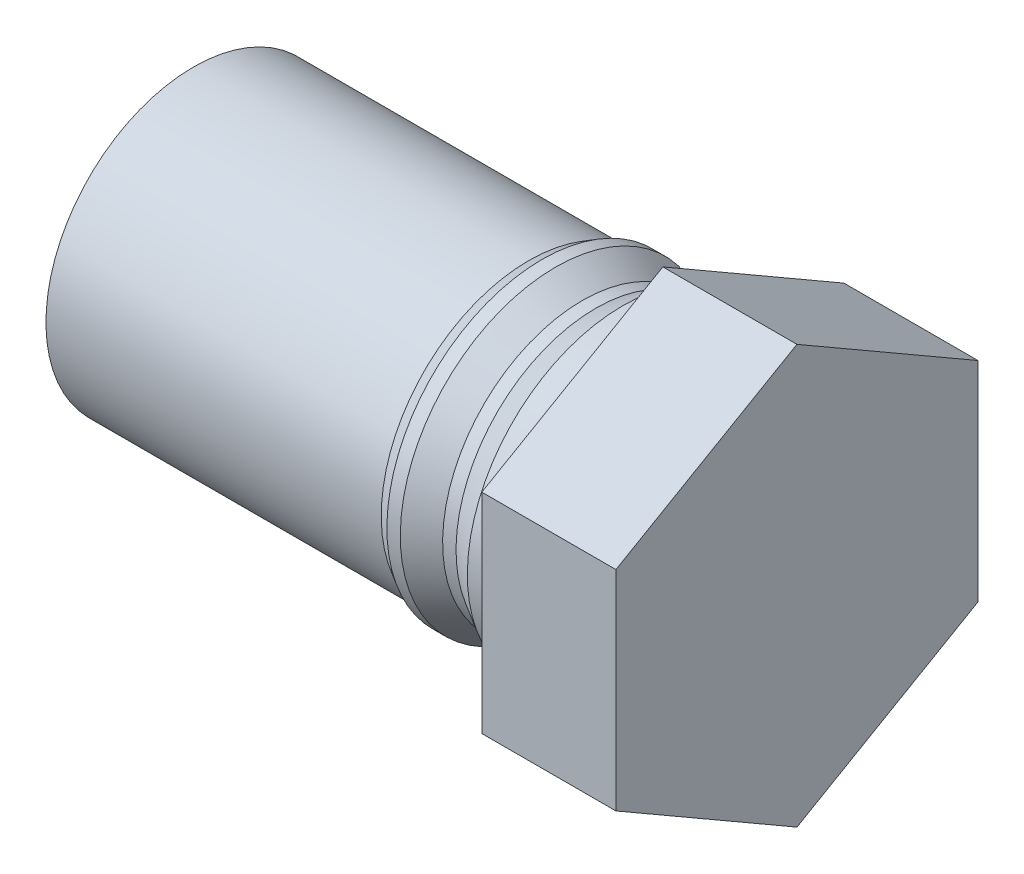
ISO-10303-21;
HEADER;
FILE_DESCRIPTION(('STEP AP214'),'2;1');
FILE_NAME('part.step','',(''),(''),'','','');
FILE_SCHEMA(('AUTOMOTIVE_DESIGN { 1 0 10303 214 1 1 1 1 }'));
ENDSEC;
DATA;
#1=APPLICATION_CONTEXT('core data for automotive mechanical design processes');
#2=APPLICATION_PROTOCOL_DEFINITION('international standard','automotive_design',2000,#1);
#3=PRODUCT_CONTEXT('',#1,'mechanical');
#4=PRODUCT('Part','Part','',(#3));
#5=PRODUCT_RELATED_PRODUCT_CATEGORY('part','',(#4));
#6=PRODUCT_DEFINITION_FORMATION('','',#4);
#7=PRODUCT_DEFINITION_CONTEXT('part definition',#1,'design');
#8=PRODUCT_DEFINITION('design','',#6,#7);
#9=PRODUCT_DEFINITION_SHAPE('','',#8);
#10=(LENGTH_UNIT() NAMED_UNIT(*) SI_UNIT(.MILLI.,.METRE.));
#11=(NAMED_UNIT(*) PLANE_ANGLE_UNIT() SI_UNIT($,.RADIAN.));
#12=(NAMED_UNIT(*) SI_UNIT($,.STERADIAN.) SOLID_ANGLE_UNIT());
#13=UNCERTAINTY_MEASURE_WITH_UNIT(LENGTH_MEASURE(1.E-05),#10,'distance_accuracy_value','');
#14=(GEOMETRIC_REPRESENTATION_CONTEXT(3) GLOBAL_UNCERTAINTY_ASSIGNED_CONTEXT((#13)) GLOBAL_UNIT_ASSIGNED_CONTEXT((#10,
#11,#12)) REPRESENTATION_CONTEXT('',''));
#15=CARTESIAN_POINT('',(0.,0.,0.));
#16=DIRECTION('',(0.,0.,1.));
#17=DIRECTION('',(1.,0.,0.));
#18=AXIS2_PLACEMENT_3D('',#15,#16,#17);
#19=CARTESIAN_POINT('',(0.,0.,0.));
#20=DIRECTION('',(-1.,0.,0.));
#21=DIRECTION('',(0.,-1.,0.));
#22=AXIS2_PLACEMENT_3D('',#19,#20,#21);
#23=PLANE('',#22);
#24=CARTESIAN_POINT('',(0.,0.,0.));
#25=DIRECTION('',(1.,0.,0.));
#26=DIRECTION('',(0.,1.,0.));
#27=AXIS2_PLACEMENT_3D('',#24,#25,#26);
#28=CIRCLE('',#27,11.);
#29=CARTESIAN_POINT('',(0.,11.,0.));
#30=VERTEX_POINT('',#29);
#31=EDGE_CURVE('E11',#30,#30,#28,.T.);
#32=ORIENTED_EDGE('',*,*,#31,.F.);
#33=EDGE_LOOP('',(#32));
#34=FACE_BOUND('',#33,.T.);
#35=ADVANCED_FACE('F33',(#34),#23,.T.);
#36=CARTESIAN_POINT('',(35.,0.,0.));
#37=DIRECTION('',(1.,0.,0.));
#38=DIRECTION('',(0.,1.,0.));
#39=AXIS2_PLACEMENT_3D('',#36,#37,#38);
#40=CYLINDRICAL_SURFACE('',#39,11.);
#41=ORIENTED_EDGE('',*,*,#31,.T.);
#42=EDGE_LOOP('',(#41));
#43=FACE_BOUND('',#42,.T.);
#44=CARTESIAN_POINT('',(25.,0.,0.));
#45=DIRECTION('',(1.,0.,0.));
#46=DIRECTION('',(0.,1.,0.));
#47=AXIS2_PLACEMENT_3D('',#44,#45,#46);
#48=CIRCLE('',#47,11.);
#49=CARTESIAN_POINT('',(25.,11.,0.));
#50=VERTEX_POINT('',#49);
#51=EDGE_CURVE('E41',#50,#50,#48,.T.);
#52=ORIENTED_EDGE('',*,*,#51,.F.);
#53=EDGE_LOOP('',(#52));
#54=FACE_BOUND('',#53,.T.);
#55=ADVANCED_FACE('F160',(#43,#54),#40,.T.);
#56=CARTESIAN_POINT('',(26.,0.,0.));
#57=DIRECTION('',(1.,0.,0.));
#58=DIRECTION('',(0.,1.,0.));
#59=AXIS2_PLACEMENT_3D('',#56,#57,#58);
#60=CONICAL_SURFACE('',#59,11.5773502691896,0.523598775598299);
#61=ORIENTED_EDGE('',*,*,#51,.T.);
#62=EDGE_LOOP('',(#61));
#63=FACE_BOUND('',#62,.T.);
#64=CARTESIAN_POINT('',(26.,0.,0.));
#65=DIRECTION('',(1.,0.,0.));
#66=DIRECTION('',(0.,1.,0.));
#67=AXIS2_PLACEMENT_3D('',#64,#65,#66);
#68=CIRCLE('',#67,11.5773502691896);
#69=CARTESIAN_POINT('',(26.,11.5773502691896,0.));
#70=VERTEX_POINT('',#69);
#71=EDGE_CURVE('E152',#70,#70,#68,.T.);
#72=ORIENTED_EDGE('',*,*,#71,.F.);
#73=EDGE_LOOP('',(#72));
#74=FACE_BOUND('',#73,.T.);
#75=ADVANCED_FACE('F157',(#63,#74),#60,.T.);
#76=CARTESIAN_POINT('',(35.,0.,0.));
#77=DIRECTION('',(1.,0.,0.));
#78=DIRECTION('',(0.,1.,0.));
#79=AXIS2_PLACEMENT_3D('',#76,#77,#78);
#80=CYLINDRICAL_SURFACE('',#79,11.5773502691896);
#81=ORIENTED_EDGE('',*,*,#71,.T.);
#82=EDGE_LOOP('',(#81));
#83=FACE_BOUND('',#82,.T.);
#84=CARTESIAN_POINT('',(27.,0.,0.));
#85=DIRECTION('',(1.,0.,0.));
#86=DIRECTION('',(0.,1.,0.));
#87=AXIS2_PLACEMENT_3D('',#84,#85,#86);
#88=CIRCLE('',#87,11.5773502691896);
#89=CARTESIAN_POINT('',(27.,11.5773502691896,0.));
#90=VERTEX_POINT('',#89);
#91=EDGE_CURVE('E149',#90,#90,#88,.T.);
#92=ORIENTED_EDGE('',*,*,#91,.F.);
#93=EDGE_LOOP('',(#92));
#94=FACE_BOUND('',#93,.T.);
#95=ADVANCED_FACE('F167',(#83,#94),#80,.T.);
#96=CARTESIAN_POINT('',(29.,0.,0.));
#97=DIRECTION('',(-1.,0.,0.));
#98=DIRECTION('',(0.,-1.,0.));
#99=AXIS2_PLACEMENT_3D('',#96,#97,#98);
#100=CONICAL_SURFACE('',#99,10.4226497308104,0.523598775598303);
#101=ORIENTED_EDGE('',*,*,#91,.T.);
#102=EDGE_LOOP('',(#101));
#103=FACE_BOUND('',#102,.T.);
#104=CARTESIAN_POINT('',(29.,0.,0.));
#105=DIRECTION('',(1.,0.,0.));
#106=DIRECTION('',(0.,1.,0.));
#107=AXIS2_PLACEMENT_3D('',#104,#105,#106);
#108=CIRCLE('',#107,10.4226497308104);
#109=CARTESIAN_POINT('',(29.,10.4226497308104,0.));
#110=VERTEX_POINT('',#109);
#111=EDGE_CURVE('E146',#110,#110,#108,.T.);
#112=ORIENTED_EDGE('',*,*,#111,.F.);
#113=EDGE_LOOP('',(#112));
#114=FACE_BOUND('',#113,.T.);
#115=ADVANCED_FACE('F173',(#103,#114),#100,.T.);
#116=CARTESIAN_POINT('',(35.,0.,0.));
#117=DIRECTION('',(1.,0.,0.));
#118=DIRECTION('',(0.,1.,0.));
#119=AXIS2_PLACEMENT_3D('',#116,#117,#118);
#120=CYLINDRICAL_SURFACE('',#119,10.4226497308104);
#121=ORIENTED_EDGE('',*,*,#111,.T.);
#122=EDGE_LOOP('',(#121));
#123=FACE_BOUND('',#122,.T.);
#124=CARTESIAN_POINT('',(30.,0.,0.));
#125=DIRECTION('',(1.,0.,0.));
#126=DIRECTION('',(0.,1.,0.));
#127=AXIS2_PLACEMENT_3D('',#124,#125,#126);
#128=CIRCLE('',#127,10.4226497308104);
#129=CARTESIAN_POINT('',(30.,10.4226497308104,0.));
#130=VERTEX_POINT('',#129);
#131=EDGE_CURVE('E143',#130,#130,#128,.T.);
#132=ORIENTED_EDGE('',*,*,#131,.F.);
#133=EDGE_LOOP('',(#132));
#134=FACE_BOUND('',#133,.T.);
#135=ADVANCED_FACE('F177',(#123,#134),#120,.T.);
#136=CARTESIAN_POINT('',(32.,0.,0.));
#137=DIRECTION('',(1.,0.,0.));
#138=DIRECTION('',(0.,1.,0.));
#139=AXIS2_PLACEMENT_3D('',#136,#137,#138);
#140=CONICAL_SURFACE('',#139,11.5773502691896,0.523598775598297);
#141=ORIENTED_EDGE('',*,*,#131,.T.);
#142=EDGE_LOOP('',(#141));
#143=FACE_BOUND('',#142,.T.);
#144=CARTESIAN_POINT('',(32.,0.,0.));
#145=DIRECTION('',(1.,0.,0.));
#146=DIRECTION('',(0.,1.,0.));
#147=AXIS2_PLACEMENT_3D('',#144,#145,#146);
#148=CIRCLE('',#147,11.5773502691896);
#149=CARTESIAN_POINT('',(32.,11.5773502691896,0.));
#150=VERTEX_POINT('',#149);
#151=EDGE_CURVE('E140',#150,#150,#148,.T.);
#152=ORIENTED_EDGE('',*,*,#151,.F.);
#153=EDGE_LOOP('',(#152));
#154=FACE_BOUND('',#153,.T.);
#155=ADVANCED_FACE('F181',(#143,#154),#140,.T.);
#156=CARTESIAN_POINT('',(35.,0.,0.));
#157=DIRECTION('',(1.,0.,0.));
#158=DIRECTION('',(0.,1.,0.));
#159=AXIS2_PLACEMENT_3D('',#156,#157,#158);
#160=CYLINDRICAL_SURFACE('',#159,11.5773502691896);
#161=ORIENTED_EDGE('',*,*,#151,.T.);
#162=EDGE_LOOP('',(#161));
#163=FACE_BOUND('',#162,.T.);
#164=CARTESIAN_POINT('',(35.,0.,0.));
#165=DIRECTION('',(1.,0.,0.));
#166=DIRECTION('',(0.,1.,0.));
#167=AXIS2_PLACEMENT_3D('',#164,#165,#166);
#168=CIRCLE('',#167,11.5773502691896);
#169=CARTESIAN_POINT('',(35.,11.5773502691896,0.));
#170=VERTEX_POINT('',#169);
#171=EDGE_CURVE('E137',#170,#170,#168,.T.);
#172=ORIENTED_EDGE('',*,*,#171,.F.);
#173=EDGE_LOOP('',(#172));
#174=FACE_BOUND('',#173,.T.);
#175=ADVANCED_FACE('F185',(#163,#174),#160,.T.);
#176=CARTESIAN_POINT('',(45.,7.79422863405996,-13.5));
#177=DIRECTION('',(0.,-0.866025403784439,0.5));
#178=DIRECTION('',(0.,-0.5,-0.866025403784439));
#179=AXIS2_PLACEMENT_3D('',#176,#177,#178);
#180=PLANE('',#179);
#181=DIRECTION('',(0.,0.5,0.866025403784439));
#182=VECTOR('',#181,1.);
#183=CARTESIAN_POINT('',(35.,7.79422863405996,-13.5));
#184=LINE('',#183,#182);
#185=CARTESIAN_POINT('',(35.,7.79422863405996,-13.5));
#186=VERTEX_POINT('',#185);
#187=CARTESIAN_POINT('',(35.,15.5884572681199,0.));
#188=VERTEX_POINT('',#187);
#189=EDGE_CURVE('E118',#186,#188,#184,.T.);
#190=ORIENTED_EDGE('',*,*,#189,.T.);
#191=DIRECTION('',(-1.,0.,0.));
#192=VECTOR('',#191,1.);
#193=CARTESIAN_POINT('',(45.,15.5884572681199,0.));
#194=LINE('',#193,#192);
#195=CARTESIAN_POINT('',(45.,15.5884572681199,0.));
#196=VERTEX_POINT('',#195);
#197=EDGE_CURVE('E135',#196,#188,#194,.T.);
#198=ORIENTED_EDGE('',*,*,#197,.F.);
#199=DIRECTION('',(0.,0.5,0.866025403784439));
#200=VECTOR('',#199,1.);
#201=CARTESIAN_POINT('',(45.,7.79422863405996,-13.5));
#202=LINE('',#201,#200);
#203=CARTESIAN_POINT('',(45.,7.79422863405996,-13.5));
#204=VERTEX_POINT('',#203);
#205=EDGE_CURVE('E128',#204,#196,#202,.T.);
#206=ORIENTED_EDGE('',*,*,#205,.F.);
#207=DIRECTION('',(-1.,0.,0.));
#208=VECTOR('',#207,1.);
#209=CARTESIAN_POINT('',(45.,7.79422863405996,-13.5));
#210=LINE('',#209,#208);
#211=EDGE_CURVE('E114',#204,#186,#210,.T.);
#212=ORIENTED_EDGE('',*,*,#211,.T.);
#213=EDGE_LOOP('',(#190,#198,#206,#212));
#214=FACE_BOUND('',#213,.T.);
#215=ADVANCED_FACE('F189',(#214),#180,.F.);
#216=CARTESIAN_POINT('',(45.,15.5884572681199,0.));
#217=DIRECTION('',(0.,-0.866025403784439,-0.5));
#218=DIRECTION('',(0.,0.5,-0.866025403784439));
#219=AXIS2_PLACEMENT_3D('',#216,#217,#218);
#220=PLANE('',#219);
#221=DIRECTION('',(0.,-0.5,0.866025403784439));
#222=VECTOR('',#221,1.);
#223=CARTESIAN_POINT('',(35.,15.5884572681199,0.));
#224=LINE('',#223,#222);
#225=CARTESIAN_POINT('',(35.,7.79422863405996,13.5));
#226=VERTEX_POINT('',#225);
#227=EDGE_CURVE('E121',#188,#226,#224,.T.);
#228=ORIENTED_EDGE('',*,*,#227,.T.);
#229=DIRECTION('',(-1.,0.,0.));
#230=VECTOR('',#229,1.);
#231=CARTESIAN_POINT('',(45.,7.79422863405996,13.5));
#232=LINE('',#231,#230);
#233=CARTESIAN_POINT('',(45.,7.79422863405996,13.5));
#234=VERTEX_POINT('',#233);
#235=EDGE_CURVE('E132',#234,#226,#232,.T.);
#236=ORIENTED_EDGE('',*,*,#235,.F.);
#237=DIRECTION('',(0.,-0.5,0.866025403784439));
#238=VECTOR('',#237,1.);
#239=CARTESIAN_POINT('',(45.,15.5884572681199,0.));
#240=LINE('',#239,#238);
#241=EDGE_CURVE('E87',#196,#234,#240,.T.);
#242=ORIENTED_EDGE('',*,*,#241,.F.);
#243=ORIENTED_EDGE('',*,*,#197,.T.);
#244=EDGE_LOOP('',(#228,#236,#242,#243));
#245=FACE_BOUND('',#244,.T.);
#246=ADVANCED_FACE('F193',(#245),#220,.F.);
#247=CARTESIAN_POINT('',(45.,7.79422863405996,13.5));
#248=DIRECTION('',(0.,0.,-1.));
#249=DIRECTION('',(-1.,0.,0.));
#250=AXIS2_PLACEMENT_3D('',#247,#248,#249);
#251=PLANE('',#250);
#252=DIRECTION('',(0.,-1.,0.));
#253=VECTOR('',#252,1.);
#254=CARTESIAN_POINT('',(35.,7.79422863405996,13.5));
#255=LINE('',#254,#253);
#256=CARTESIAN_POINT('',(35.,-7.79422863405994,13.5));
#257=VERTEX_POINT('',#256);
#258=EDGE_CURVE('E123',#226,#257,#255,.T.);
#259=ORIENTED_EDGE('',*,*,#258,.T.);
#260=DIRECTION('',(-1.,0.,0.));
#261=VECTOR('',#260,1.);
#262=CARTESIAN_POINT('',(45.,-7.79422863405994,13.5));
#263=LINE('',#262,#261);
#264=CARTESIAN_POINT('',(45.,-7.79422863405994,13.5));
#265=VERTEX_POINT('',#264);
#266=EDGE_CURVE('E109',#265,#257,#263,.T.);
#267=ORIENTED_EDGE('',*,*,#266,.F.);
#268=DIRECTION('',(0.,-1.,0.));
#269=VECTOR('',#268,1.);
#270=CARTESIAN_POINT('',(45.,7.79422863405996,13.5));
#271=LINE('',#270,#269);
#272=EDGE_CURVE('E100',#234,#265,#271,.T.);
#273=ORIENTED_EDGE('',*,*,#272,.F.);
#274=ORIENTED_EDGE('',*,*,#235,.T.);
#275=EDGE_LOOP('',(#259,#267,#273,#274));
#276=FACE_BOUND('',#275,.T.);
#277=ADVANCED_FACE('F197',(#276),#251,.F.);
#278=CARTESIAN_POINT('',(45.,-7.79422863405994,13.5));
#279=DIRECTION('',(0.,0.866025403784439,-0.5));
#280=DIRECTION('',(0.,0.5,0.866025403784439));
#281=AXIS2_PLACEMENT_3D('',#278,#279,#280);
#282=PLANE('',#281);
#283=DIRECTION('',(0.,-0.5,-0.866025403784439));
#284=VECTOR('',#283,1.);
#285=CARTESIAN_POINT('',(35.,-7.79422863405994,13.5));
#286=LINE('',#285,#284);
#287=CARTESIAN_POINT('',(35.,-15.5884572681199,0.));
#288=VERTEX_POINT('',#287);
#289=EDGE_CURVE('E108',#257,#288,#286,.T.);
#290=ORIENTED_EDGE('',*,*,#289,.T.);
#291=DIRECTION('',(-1.,0.,0.));
#292=VECTOR('',#291,1.);
#293=CARTESIAN_POINT('',(45.,-15.5884572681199,0.));
#294=LINE('',#293,#292);
#295=CARTESIAN_POINT('',(45.,-15.5884572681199,0.));
#296=VERTEX_POINT('',#295);
#297=EDGE_CURVE('E105',#296,#288,#294,.T.);
#298=ORIENTED_EDGE('',*,*,#297,.F.);
#299=DIRECTION('',(0.,-0.5,-0.866025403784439));
#300=VECTOR('',#299,1.);
#301=CARTESIAN_POINT('',(45.,-7.79422863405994,13.5));
#302=LINE('',#301,#300);
#303=EDGE_CURVE('E94',#265,#296,#302,.T.);
#304=ORIENTED_EDGE('',*,*,#303,.F.);
#305=ORIENTED_EDGE('',*,*,#266,.T.);
#306=EDGE_LOOP('',(#290,#298,#304,#305));
#307=FACE_BOUND('',#306,.T.);
#308=ADVANCED_FACE('F106',(#307),#282,.F.);
#309=CARTESIAN_POINT('',(45.,-15.5884572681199,0.));
#310=DIRECTION('',(0.,0.866025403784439,0.5));
#311=DIRECTION('',(0.,-0.5,0.866025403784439));
#312=AXIS2_PLACEMENT_3D('',#309,#310,#311);
#313=PLANE('',#312);
#314=DIRECTION('',(0.,0.5,-0.866025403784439));
#315=VECTOR('',#314,1.);
#316=CARTESIAN_POINT('',(35.,-15.5884572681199,0.));
#317=LINE('',#316,#315);
#318=CARTESIAN_POINT('',(35.,-7.79422863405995,-13.5));
#319=VERTEX_POINT('',#318);
#320=EDGE_CURVE('E72',#288,#319,#317,.T.);
#321=ORIENTED_EDGE('',*,*,#320,.T.);
#322=DIRECTION('',(-1.,0.,0.));
#323=VECTOR('',#322,1.);
#324=CARTESIAN_POINT('',(45.,-7.79422863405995,-13.5));
#325=LINE('',#324,#323);
#326=CARTESIAN_POINT('',(45.,-7.79422863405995,-13.5));
#327=VERTEX_POINT('',#326);
#328=EDGE_CURVE('E110',#327,#319,#325,.T.);
#329=ORIENTED_EDGE('',*,*,#328,.F.);
#330=DIRECTION('',(0.,0.5,-0.866025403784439));
#331=VECTOR('',#330,1.);
#332=CARTESIAN_POINT('',(45.,-15.5884572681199,0.));
#333=LINE('',#332,#331);
#334=EDGE_CURVE('E98',#296,#327,#333,.T.);
#335=ORIENTED_EDGE('',*,*,#334,.F.);
#336=ORIENTED_EDGE('',*,*,#297,.T.);
#337=EDGE_LOOP('',(#321,#329,#335,#336));
#338=FACE_BOUND('',#337,.T.);
#339=ADVANCED_FACE('F112',(#338),#313,.F.);
#340=CARTESIAN_POINT('',(45.,-7.79422863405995,-13.5));
#341=DIRECTION('',(0.,0.,1.));
#342=DIRECTION('',(0.,-1.,0.));
#343=AXIS2_PLACEMENT_3D('',#340,#341,#342);
#344=PLANE('',#343);
#345=DIRECTION('',(0.,1.,0.));
#346=VECTOR('',#345,1.);
#347=CARTESIAN_POINT('',(35.,-7.79422863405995,-13.5));
#348=LINE('',#347,#346);
#349=EDGE_CURVE('E78',#319,#186,#348,.T.);
#350=ORIENTED_EDGE('',*,*,#349,.T.);
#351=ORIENTED_EDGE('',*,*,#211,.F.);
#352=DIRECTION('',(0.,1.,0.));
#353=VECTOR('',#352,1.);
#354=CARTESIAN_POINT('',(45.,-7.79422863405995,-13.5));
#355=LINE('',#354,#353);
#356=EDGE_CURVE('E49',#327,#204,#355,.T.);
#357=ORIENTED_EDGE('',*,*,#356,.F.);
#358=ORIENTED_EDGE('',*,*,#328,.T.);
#359=EDGE_LOOP('',(#350,#351,#357,#358));
#360=FACE_BOUND('',#359,.T.);
#361=ADVANCED_FACE('F205',(#360),#344,.F.);
#362=CARTESIAN_POINT('',(45.,0.,0.));
#363=DIRECTION('',(1.,0.,0.));
#364=DIRECTION('',(0.,0.,-1.));
#365=AXIS2_PLACEMENT_3D('',#362,#363,#364);
#366=PLANE('',#365);
#367=ORIENTED_EDGE('',*,*,#205,.T.);
#368=ORIENTED_EDGE('',*,*,#241,.T.);
#369=ORIENTED_EDGE('',*,*,#272,.T.);
#370=ORIENTED_EDGE('',*,*,#303,.T.);
#371=ORIENTED_EDGE('',*,*,#334,.T.);
#372=ORIENTED_EDGE('',*,*,#356,.T.);
#373=EDGE_LOOP('',(#367,#368,#369,#370,#371,#372));
#374=FACE_BOUND('',#373,.T.);
#375=ADVANCED_FACE('F96',(#374),#366,.T.);
#376=CARTESIAN_POINT('',(35.,0.,0.));
#377=DIRECTION('',(1.,0.,0.));
#378=DIRECTION('',(0.,0.,-1.));
#379=AXIS2_PLACEMENT_3D('',#376,#377,#378);
#380=PLANE('',#379);
#381=ORIENTED_EDGE('',*,*,#171,.T.);
#382=EDGE_LOOP('',(#381));
#383=FACE_BOUND('',#382,.T.);
#384=ORIENTED_EDGE('',*,*,#189,.F.);
#385=ORIENTED_EDGE('',*,*,#349,.F.);
#386=ORIENTED_EDGE('',*,*,#320,.F.);
#387=ORIENTED_EDGE('',*,*,#289,.F.);
#388=ORIENTED_EDGE('',*,*,#258,.F.);
#389=ORIENTED_EDGE('',*,*,#227,.F.);
#390=EDGE_LOOP('',(#384,#385,#386,#387,#388,#389));
#391=FACE_BOUND('',#390,.T.);
#392=ADVANCED_FACE('F208',(#383,#391),#380,.F.);
#393=CLOSED_SHELL('',(#35,#55,#75,#95,#115,#135,#155,#175,#215,#246,#277,#308,#339,#361,#375,#392));
#394=MANIFOLD_SOLID_BREP('B2',#393);
#395=ADVANCED_BREP_SHAPE_REPRESENTATION('',(#18,#394),#14);
#396=SHAPE_DEFINITION_REPRESENTATION(#9,#395);
ENDSEC;
END-ISO-10303-21;
